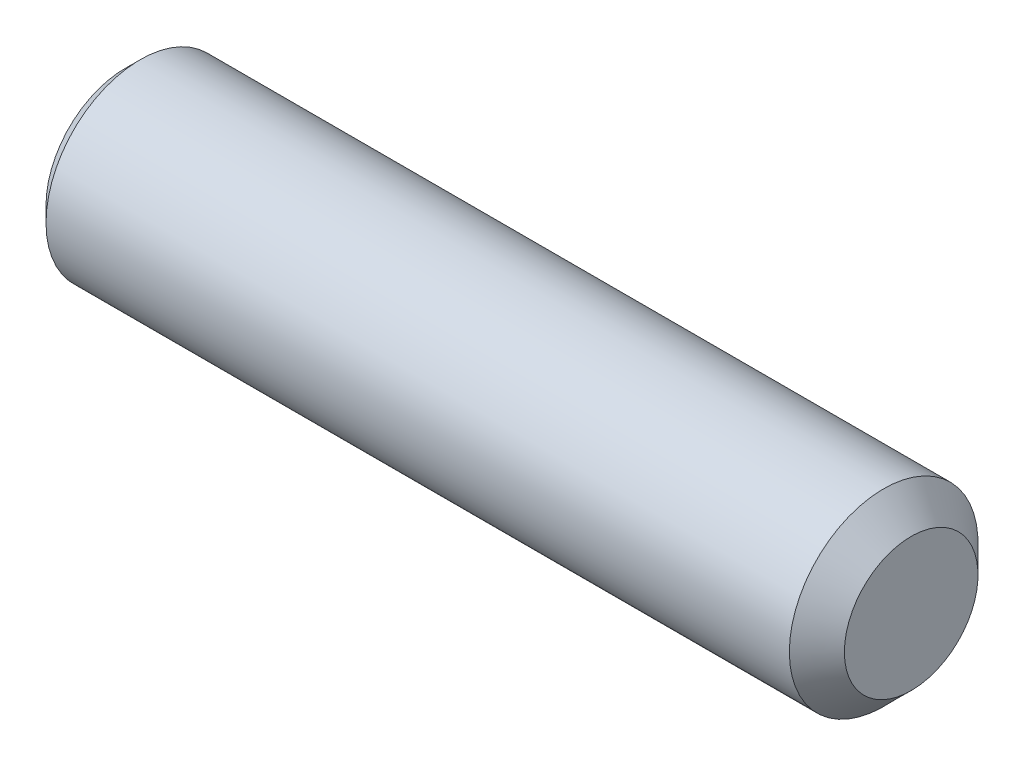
from build123d import *

# Parameters (mm, degrees)
COUNTERSINK_DEPTH = 8


with BuildPart() as part:
    # BodySke → BaseBody (revolve)
    with BuildSketch(Plane.XY, mode=Mode.PRIVATE) as basebody_sk:
        Polygon((0, 0), (0, 5.036), (0.964, 6), (48.25, 6), (50, 4.25), (50, 0), align=None)
    revolve(basebody_sk.sketch.rotate(Axis((0, 0, 0), (1, 0, 0)), 90), axis=Axis((0, 0, 0), (1, 0, 0)))

    # CountersinkSke → Countersink (cut)
    with BuildSketch(Plane(origin=(0, 0, 0), x_dir=(0, 0, -1), z_dir=(1, 0, 0))):
        Polygon((0, 3.464101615), (-3, 1.732050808), (-3, -1.732050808), (0, -3.464101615), (3, -1.732050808), (3, 1.732050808), align=None)
    extrude(amount=COUNTERSINK_DEPTH, mode=Mode.SUBTRACT)


solid = part.part
